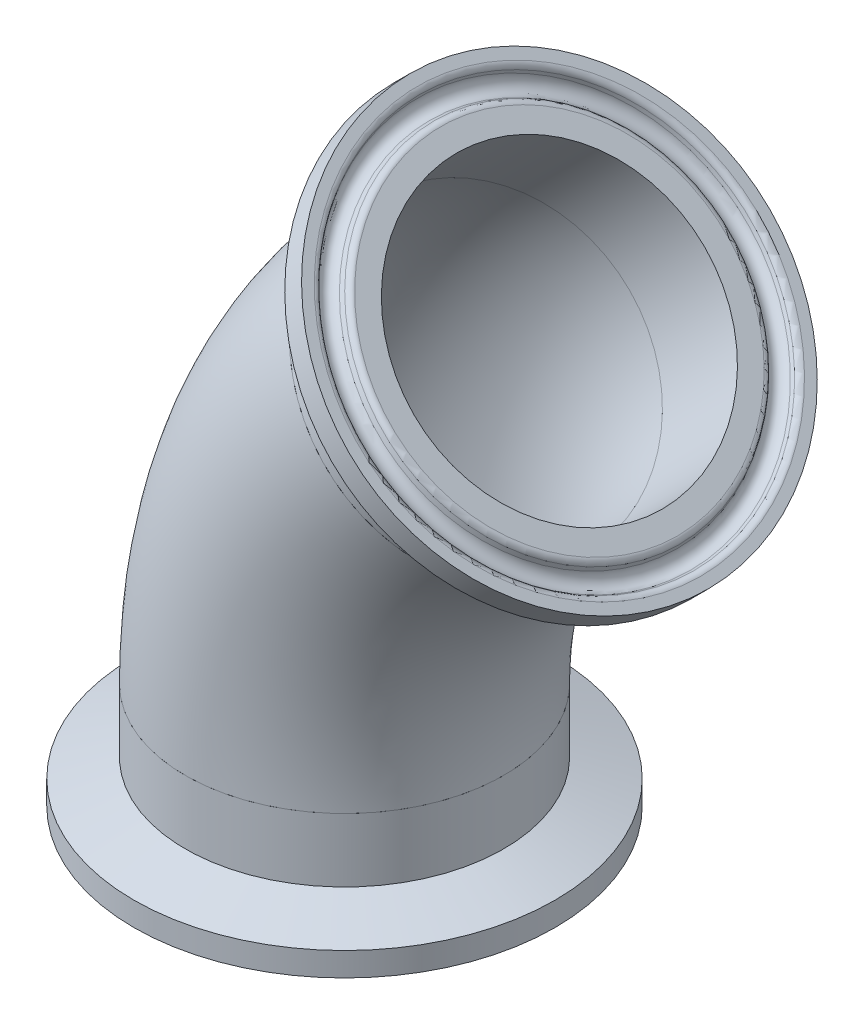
ISO-10303-21;
HEADER;
FILE_DESCRIPTION(('STEP AP214'),'2;1');
FILE_NAME('part.step','',(''),(''),'','','');
FILE_SCHEMA(('AUTOMOTIVE_DESIGN { 1 0 10303 214 1 1 1 1 }'));
ENDSEC;
DATA;
#1=APPLICATION_CONTEXT('core data for automotive mechanical design processes');
#2=APPLICATION_PROTOCOL_DEFINITION('international standard','automotive_design',2000,#1);
#3=PRODUCT_CONTEXT('',#1,'mechanical');
#4=PRODUCT('Part','Part','',(#3));
#5=PRODUCT_RELATED_PRODUCT_CATEGORY('part','',(#4));
#6=PRODUCT_DEFINITION_FORMATION('','',#4);
#7=PRODUCT_DEFINITION_CONTEXT('part definition',#1,'design');
#8=PRODUCT_DEFINITION('design','',#6,#7);
#9=PRODUCT_DEFINITION_SHAPE('','',#8);
#10=(LENGTH_UNIT() NAMED_UNIT(*) SI_UNIT(.MILLI.,.METRE.));
#11=(NAMED_UNIT(*) PLANE_ANGLE_UNIT() SI_UNIT($,.RADIAN.));
#12=(NAMED_UNIT(*) SI_UNIT($,.STERADIAN.) SOLID_ANGLE_UNIT());
#13=UNCERTAINTY_MEASURE_WITH_UNIT(LENGTH_MEASURE(1.E-05),#10,'distance_accuracy_value','');
#14=(GEOMETRIC_REPRESENTATION_CONTEXT(3) GLOBAL_UNCERTAINTY_ASSIGNED_CONTEXT((#13)) GLOBAL_UNIT_ASSIGNED_CONTEXT((#10,
#11,#12)) REPRESENTATION_CONTEXT('',''));
#15=CARTESIAN_POINT('',(0.,0.,0.));
#16=DIRECTION('',(0.,0.,1.));
#17=DIRECTION('',(1.,0.,0.));
#18=AXIS2_PLACEMENT_3D('',#15,#16,#17);
#19=CARTESIAN_POINT('',(66.8663289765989,3.66193996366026,33.3026614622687));
#20=DIRECTION('',(0.,0.,1.));
#21=DIRECTION('',(1.00000000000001,0.,0.));
#22=AXIS2_PLACEMENT_3D('',#19,#20,#21);
#23=TOROIDAL_SURFACE('',#22,57.15,19.05);
#24=CARTESIAN_POINT('',(26.4551764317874,44.0730925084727,33.3026614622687));
#25=DIRECTION('',(0.707106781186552,0.707106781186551,0.));
#26=DIRECTION('',(0.,0.,1.));
#27=AXIS2_PLACEMENT_3D('',#24,#25,#26);
#28=CIRCLE('',#27,19.05);
#29=CARTESIAN_POINT('',(12.9847922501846,57.5434766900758,33.3026614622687));
#30=VERTEX_POINT('',#29);
#31=EDGE_CURVE('P0_E10',#30,#30,#28,.T.);
#32=CARTESIAN_POINT('',(9.71632897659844,3.66193996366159,33.3026614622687));
#33=DIRECTION('',(0.,1.00000000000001,0.));
#34=DIRECTION('',(0.,0.,1.));
#35=AXIS2_PLACEMENT_3D('',#32,#33,#34);
#36=CIRCLE('',#35,19.05);
#37=CARTESIAN_POINT('',(-9.33367102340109,3.66193996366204,33.3026614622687));
#38=VERTEX_POINT('',#37);
#39=EDGE_CURVE('P0_E21',#38,#38,#36,.T.);
#40=CARTESIAN_POINT('',(66.8663289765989,3.66193996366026,33.3026614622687));
#41=DIRECTION('',(0.,0.,1.));
#42=DIRECTION('',(1.00000000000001,0.,0.));
#43=AXIS2_PLACEMENT_3D('',#40,#41,#42);
#44=CIRCLE('',#43,76.2);
#45=EDGE_CURVE('',#30,#38,#44,.T.);
#46=ORIENTED_EDGE('',*,*,#31,.F.);
#47=ORIENTED_EDGE('',*,*,#39,.T.);
#48=ORIENTED_EDGE('',*,*,#45,.T.);
#49=ORIENTED_EDGE('',*,*,#45,.F.);
#50=EDGE_LOOP('',(#46,#48,#47,#49));
#51=FACE_BOUND('',#50,.T.);
#52=ADVANCED_FACE('P0_F15',(#51),#23,.T.);
#53=CARTESIAN_POINT('',(26.4551764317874,44.0730925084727,33.3026614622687));
#54=DIRECTION('',(0.707106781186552,0.707106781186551,0.));
#55=DIRECTION('',(0.,0.,1.));
#56=AXIS2_PLACEMENT_3D('',#53,#54,#55);
#57=PLANE('',#56);
#58=CARTESIAN_POINT('',(26.4551764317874,44.0730925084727,33.3026614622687));
#59=DIRECTION('',(0.707106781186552,0.707106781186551,0.));
#60=DIRECTION('',(-0.707106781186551,0.707106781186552,0.));
#61=AXIS2_PLACEMENT_3D('',#58,#59,#60);
#62=CIRCLE('',#61,17.399);
#63=CARTESIAN_POINT('',(14.1522255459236,56.3760433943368,33.3026614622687));
#64=VERTEX_POINT('',#63);
#65=EDGE_CURVE('P0_E25',#64,#64,#62,.T.);
#66=ORIENTED_EDGE('',*,*,#65,.F.);
#67=EDGE_LOOP('',(#66));
#68=FACE_BOUND('',#67,.T.);
#69=ORIENTED_EDGE('',*,*,#31,.T.);
#70=EDGE_LOOP('',(#69));
#71=FACE_BOUND('',#70,.T.);
#72=ADVANCED_FACE('P0_F46',(#68,#71),#57,.T.);
#73=CARTESIAN_POINT('',(9.71632897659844,3.66193996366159,33.3026614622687));
#74=DIRECTION('',(0.,1.00000000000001,0.));
#75=DIRECTION('',(0.,0.,1.));
#76=AXIS2_PLACEMENT_3D('',#73,#74,#75);
#77=PLANE('',#76);
#78=CARTESIAN_POINT('',(9.71632897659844,3.66193996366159,33.3026614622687));
#79=DIRECTION('',(0.,1.00000000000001,0.));
#80=DIRECTION('',(0.,0.,1.));
#81=AXIS2_PLACEMENT_3D('',#78,#79,#80);
#82=CIRCLE('',#81,17.399);
#83=CARTESIAN_POINT('',(-7.68267102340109,3.661939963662,33.3026614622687));
#84=VERTEX_POINT('',#83);
#85=EDGE_CURVE('P0_E29',#84,#84,#82,.T.);
#86=ORIENTED_EDGE('',*,*,#85,.T.);
#87=EDGE_LOOP('',(#86));
#88=FACE_BOUND('',#87,.T.);
#89=ORIENTED_EDGE('',*,*,#39,.F.);
#90=EDGE_LOOP('',(#89));
#91=FACE_BOUND('',#90,.T.);
#92=ADVANCED_FACE('P0_F35',(#88,#91),#77,.F.);
#93=CARTESIAN_POINT('',(66.8663289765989,3.66193996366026,33.3026614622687));
#94=DIRECTION('',(0.,0.,1.));
#95=DIRECTION('',(1.00000000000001,0.,0.));
#96=AXIS2_PLACEMENT_3D('',#93,#94,#95);
#97=TOROIDAL_SURFACE('',#96,57.15,17.399);
#98=CARTESIAN_POINT('',(66.8663289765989,3.66193996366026,33.3026614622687));
#99=DIRECTION('',(0.,0.,1.));
#100=DIRECTION('',(1.00000000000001,0.,0.));
#101=AXIS2_PLACEMENT_3D('',#98,#99,#100);
#102=CIRCLE('',#101,74.549);
#103=EDGE_CURVE('',#64,#84,#102,.T.);
#104=ORIENTED_EDGE('',*,*,#65,.T.);
#105=ORIENTED_EDGE('',*,*,#85,.F.);
#106=ORIENTED_EDGE('',*,*,#103,.T.);
#107=ORIENTED_EDGE('',*,*,#103,.F.);
#108=EDGE_LOOP('',(#104,#106,#105,#107));
#109=FACE_BOUND('',#108,.T.);
#110=ADVANCED_FACE('P0_F38',(#109),#97,.F.);
#111=CLOSED_SHELL('',(#52,#72,#92,#110));
#112=MANIFOLD_SOLID_BREP('P0_B1',#111);
#113=CARTESIAN_POINT('',(34.7396402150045,52.3575562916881,33.3026614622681));
#114=DIRECTION('',(-0.707106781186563,-0.707106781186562,0.));
#115=DIRECTION('',(-0.707106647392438,0.707106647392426,-0.000615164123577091));
#116=AXIS2_PLACEMENT_3D('',#113,#114,#115);
#117=CONICAL_SURFACE('',#116,20.9336326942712,0.401425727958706);
#118=CARTESIAN_POINT('',(35.1071491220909,52.7250651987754,33.3026614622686));
#119=DIRECTION('',(0.707106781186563,0.707106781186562,0.));
#120=DIRECTION('',(0.707106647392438,-0.707106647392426,0.000615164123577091));
#121=AXIS2_PLACEMENT_3D('',#118,#119,#120);
#122=CIRCLE('',#121,20.7130178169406);
#123=CARTESIAN_POINT('',(49.7534617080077,38.0787526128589,33.3154033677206));
#124=VERTEX_POINT('',#123);
#125=EDGE_CURVE('P1_E9',#124,#124,#122,.T.);
#126=ORIENTED_EDGE('',*,*,#125,.F.);
#127=EDGE_LOOP('',(#126));
#128=FACE_BOUND('',#127,.T.);
#129=CARTESIAN_POINT('',(34.7396402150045,52.3575562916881,33.3026614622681));
#130=DIRECTION('',(0.707106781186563,0.707106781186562,0.));
#131=DIRECTION('',(0.707106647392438,-0.707106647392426,0.000615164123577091));
#132=AXIS2_PLACEMENT_3D('',#129,#130,#131);
#133=CIRCLE('',#132,20.9336326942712);
#134=CARTESIAN_POINT('',(49.5419510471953,37.5552454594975,33.3155390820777));
#135=VERTEX_POINT('',#134);
#136=EDGE_CURVE('P1_E54',#135,#135,#133,.T.);
#137=ORIENTED_EDGE('',*,*,#136,.T.);
#138=EDGE_LOOP('',(#137));
#139=FACE_BOUND('',#138,.T.);
#140=ADVANCED_FACE('P1_F14',(#128,#139),#117,.T.);
#141=CARTESIAN_POINT('',(34.896617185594,52.5145332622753,33.3026614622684));
#142=DIRECTION('',(0.707106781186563,0.707106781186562,0.));
#143=DIRECTION('',(0.707106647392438,-0.707106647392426,0.000615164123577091));
#144=AXIS2_PLACEMENT_3D('',#141,#142,#143);
#145=TOROIDAL_SURFACE('',#144,20.0115931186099,0.761999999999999);
#146=CARTESIAN_POINT('',(35.4354325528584,53.0533486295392,33.3026614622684));
#147=DIRECTION('',(0.707106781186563,0.707106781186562,0.));
#148=DIRECTION('',(0.707106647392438,-0.707106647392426,0.000615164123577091));
#149=AXIS2_PLACEMENT_3D('',#146,#147,#148);
#150=CIRCLE('',#149,20.0115931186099);
#151=CARTESIAN_POINT('',(49.5857630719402,38.9030181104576,33.3149718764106));
#152=VERTEX_POINT('',#151);
#153=EDGE_CURVE('P1_E20',#152,#152,#150,.T.);
#154=ORIENTED_EDGE('',*,*,#153,.F.);
#155=EDGE_LOOP('',(#154));
#156=FACE_BOUND('',#155,.T.);
#157=ORIENTED_EDGE('',*,*,#125,.T.);
#158=EDGE_LOOP('',(#157));
#159=FACE_BOUND('',#158,.T.);
#160=ADVANCED_FACE('P1_F84',(#156,#159),#145,.T.);
#161=CARTESIAN_POINT('',(35.4354325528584,53.0533486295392,33.3026614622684));
#162=DIRECTION('',(-0.707106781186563,-0.707106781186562,0.));
#163=DIRECTION('',(-0.707106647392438,0.707106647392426,-0.000615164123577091));
#164=AXIS2_PLACEMENT_3D('',#161,#162,#163);
#165=PLANE('',#164);
#166=CARTESIAN_POINT('',(35.4354325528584,53.0533486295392,33.3026614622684));
#167=DIRECTION('',(0.707106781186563,0.707106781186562,0.));
#168=DIRECTION('',(0.707106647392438,-0.707106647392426,0.000615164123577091));
#169=AXIS2_PLACEMENT_3D('',#166,#167,#168);
#170=CIRCLE('',#169,17.399);
#171=CARTESIAN_POINT('',(47.7383811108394,40.7504000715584,33.3133647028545));
#172=VERTEX_POINT('',#171);
#173=EDGE_CURVE('P1_E24',#172,#172,#170,.T.);
#174=ORIENTED_EDGE('',*,*,#173,.F.);
#175=EDGE_LOOP('',(#174));
#176=FACE_BOUND('',#175,.T.);
#177=ORIENTED_EDGE('',*,*,#153,.T.);
#178=EDGE_LOOP('',(#177));
#179=FACE_BOUND('',#178,.T.);
#180=ADVANCED_FACE('P1_F89',(#176,#179),#165,.F.);
#181=CARTESIAN_POINT('',(35.4354325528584,53.0533486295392,33.3026614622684));
#182=DIRECTION('',(0.707106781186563,0.707106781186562,0.));
#183=DIRECTION('',(0.707106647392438,-0.707106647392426,0.000615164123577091));
#184=AXIS2_PLACEMENT_3D('',#181,#182,#183);
#185=CYLINDRICAL_SURFACE('',#184,17.399);
#186=ORIENTED_EDGE('',*,*,#173,.T.);
#187=EDGE_LOOP('',(#186));
#188=FACE_BOUND('',#187,.T.);
#189=CARTESIAN_POINT('',(26.4551764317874,44.0730925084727,33.3026614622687));
#190=DIRECTION('',(0.707106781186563,0.707106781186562,0.));
#191=DIRECTION('',(0.707106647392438,-0.707106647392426,0.000615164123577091));
#192=AXIS2_PLACEMENT_3D('',#189,#190,#191);
#193=CIRCLE('',#192,17.399);
#194=CARTESIAN_POINT('',(38.7581249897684,31.7701439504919,33.3133647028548));
#195=VERTEX_POINT('',#194);
#196=EDGE_CURVE('P1_E28',#195,#195,#193,.T.);
#197=ORIENTED_EDGE('',*,*,#196,.F.);
#198=EDGE_LOOP('',(#197));
#199=FACE_BOUND('',#198,.T.);
#200=ADVANCED_FACE('P1_F94',(#188,#199),#185,.F.);
#201=CARTESIAN_POINT('',(26.4551764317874,44.0730925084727,33.3026614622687));
#202=DIRECTION('',(0.707106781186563,0.707106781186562,0.));
#203=DIRECTION('',(0.707106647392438,-0.707106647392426,0.000615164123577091));
#204=AXIS2_PLACEMENT_3D('',#201,#202,#203);
#205=PLANE('',#204);
#206=CARTESIAN_POINT('',(26.4551764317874,44.0730925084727,33.3026614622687));
#207=DIRECTION('',(0.707106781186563,0.707106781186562,0.));
#208=DIRECTION('',(0.707106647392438,-0.707106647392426,0.000615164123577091));
#209=AXIS2_PLACEMENT_3D('',#206,#207,#208);
#210=CIRCLE('',#209,19.05);
#211=CARTESIAN_POINT('',(39.9255580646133,30.602710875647,33.3143803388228));
#212=VERTEX_POINT('',#211);
#213=EDGE_CURVE('P1_E33',#212,#212,#210,.T.);
#214=ORIENTED_EDGE('',*,*,#213,.F.);
#215=EDGE_LOOP('',(#214));
#216=FACE_BOUND('',#215,.T.);
#217=ORIENTED_EDGE('',*,*,#196,.T.);
#218=EDGE_LOOP('',(#217));
#219=FACE_BOUND('',#218,.T.);
#220=ADVANCED_FACE('P1_F100',(#216,#219),#205,.F.);
#221=CARTESIAN_POINT('',(35.4354325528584,53.0533486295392,33.3026614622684));
#222=DIRECTION('',(0.707106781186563,0.707106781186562,0.));
#223=DIRECTION('',(0.707106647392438,-0.707106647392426,0.000615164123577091));
#224=AXIS2_PLACEMENT_3D('',#221,#222,#223);
#225=CYLINDRICAL_SURFACE('',#224,19.05);
#226=CARTESIAN_POINT('',(31.8418789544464,49.4597950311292,33.3026614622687));
#227=DIRECTION('',(0.707106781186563,0.707106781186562,0.));
#228=DIRECTION('',(0.707106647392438,-0.707106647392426,0.000615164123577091));
#229=AXIS2_PLACEMENT_3D('',#226,#227,#228);
#230=CIRCLE('',#229,19.05);
#231=CARTESIAN_POINT('',(45.3122605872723,35.9894133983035,33.3143803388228));
#232=VERTEX_POINT('',#231);
#233=EDGE_CURVE('P1_E36',#232,#232,#230,.T.);
#234=ORIENTED_EDGE('',*,*,#233,.F.);
#235=EDGE_LOOP('',(#234));
#236=FACE_BOUND('',#235,.T.);
#237=ORIENTED_EDGE('',*,*,#213,.T.);
#238=EDGE_LOOP('',(#237));
#239=FACE_BOUND('',#238,.T.);
#240=ADVANCED_FACE('P1_F104',(#236,#239),#225,.T.);
#241=CARTESIAN_POINT('',(31.8418789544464,49.4597950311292,33.3026614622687));
#242=DIRECTION('',(0.707106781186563,0.707106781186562,0.));
#243=DIRECTION('',(0.707106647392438,-0.707106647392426,0.000615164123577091));
#244=AXIS2_PLACEMENT_3D('',#241,#242,#243);
#245=CONICAL_SURFACE('',#244,19.05,1.22173047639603);
#246=CARTESIAN_POINT('',(33.4238551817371,51.0417712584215,33.3026614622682));
#247=DIRECTION('',(0.707106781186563,0.707106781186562,0.));
#248=DIRECTION('',(0.707106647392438,-0.707106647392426,0.000615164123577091));
#249=AXIS2_PLACEMENT_3D('',#246,#247,#248);
#250=CIRCLE('',#249,25.1968);
#251=CARTESIAN_POINT('',(51.2406799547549,33.224946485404,33.3181616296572));
#252=VERTEX_POINT('',#251);
#253=EDGE_CURVE('P1_E39',#252,#252,#250,.T.);
#254=ORIENTED_EDGE('',*,*,#253,.F.);
#255=EDGE_LOOP('',(#254));
#256=FACE_BOUND('',#255,.T.);
#257=ORIENTED_EDGE('',*,*,#233,.T.);
#258=EDGE_LOOP('',(#257));
#259=FACE_BOUND('',#258,.T.);
#260=ADVANCED_FACE('P1_F108',(#256,#259),#245,.T.);
#261=CARTESIAN_POINT('',(35.4354325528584,53.0533486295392,33.3026614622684));
#262=DIRECTION('',(0.707106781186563,0.707106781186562,0.));
#263=DIRECTION('',(0.707106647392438,-0.707106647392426,0.000615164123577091));
#264=AXIS2_PLACEMENT_3D('',#261,#262,#263);
#265=CYLINDRICAL_SURFACE('',#264,25.1968);
#266=CARTESIAN_POINT('',(35.4354325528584,53.0533486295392,33.3026614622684));
#267=DIRECTION('',(0.707106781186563,0.707106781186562,0.));
#268=DIRECTION('',(0.707106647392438,-0.707106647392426,0.000615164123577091));
#269=AXIS2_PLACEMENT_3D('',#266,#267,#268);
#270=CIRCLE('',#269,25.1968);
#271=CARTESIAN_POINT('',(53.2522573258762,35.2365238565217,33.3181616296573));
#272=VERTEX_POINT('',#271);
#273=EDGE_CURVE('P1_E42',#272,#272,#270,.T.);
#274=ORIENTED_EDGE('',*,*,#273,.F.);
#275=EDGE_LOOP('',(#274));
#276=FACE_BOUND('',#275,.T.);
#277=ORIENTED_EDGE('',*,*,#253,.T.);
#278=EDGE_LOOP('',(#277));
#279=FACE_BOUND('',#278,.T.);
#280=ADVANCED_FACE('P1_F80',(#276,#279),#265,.T.);
#281=CARTESIAN_POINT('',(35.4354325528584,53.0533486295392,33.3026614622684));
#282=DIRECTION('',(-0.707106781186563,-0.707106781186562,0.));
#283=DIRECTION('',(-0.707106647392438,0.707106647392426,-0.000615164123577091));
#284=AXIS2_PLACEMENT_3D('',#281,#282,#283);
#285=PLANE('',#284);
#286=CARTESIAN_POINT('',(35.4354325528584,53.0533486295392,33.3026614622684));
#287=DIRECTION('',(0.707106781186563,0.707106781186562,0.));
#288=DIRECTION('',(0.707106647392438,-0.707106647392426,0.000615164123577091));
#289=AXIS2_PLACEMENT_3D('',#286,#287,#288);
#290=CIRCLE('',#289,23.9521599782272);
#291=CARTESIAN_POINT('',(52.37216409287,36.1166170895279,33.3173959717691));
#292=VERTEX_POINT('',#291);
#293=EDGE_CURVE('P1_E45',#292,#292,#290,.T.);
#294=ORIENTED_EDGE('',*,*,#293,.F.);
#295=EDGE_LOOP('',(#294));
#296=FACE_BOUND('',#295,.T.);
#297=ORIENTED_EDGE('',*,*,#273,.T.);
#298=EDGE_LOOP('',(#297));
#299=FACE_BOUND('',#298,.T.);
#300=ADVANCED_FACE('P1_F73',(#296,#299),#285,.F.);
#301=CARTESIAN_POINT('',(34.896617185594,52.5145332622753,33.3026614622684));
#302=DIRECTION('',(0.707106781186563,0.707106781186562,0.));
#303=DIRECTION('',(0.707106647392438,-0.707106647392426,0.000615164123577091));
#304=AXIS2_PLACEMENT_3D('',#301,#302,#303);
#305=TOROIDAL_SURFACE('',#304,23.9521599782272,0.761999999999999);
#306=ORIENTED_EDGE('',*,*,#293,.T.);
#307=EDGE_LOOP('',(#306));
#308=FACE_BOUND('',#307,.T.);
#309=CARTESIAN_POINT('',(35.1071491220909,52.7250651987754,33.3026614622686));
#310=DIRECTION('',(0.707106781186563,0.707106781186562,0.));
#311=DIRECTION('',(0.707106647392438,-0.707106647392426,0.000615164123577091));
#312=AXIS2_PLACEMENT_3D('',#309,#310,#311);
#313=CIRCLE('',#312,23.2507352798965);
#314=CARTESIAN_POINT('',(51.5478985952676,36.284315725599,33.3169644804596));
#315=VERTEX_POINT('',#314);
#316=EDGE_CURVE('P1_E48',#315,#315,#313,.T.);
#317=ORIENTED_EDGE('',*,*,#316,.F.);
#318=EDGE_LOOP('',(#317));
#319=FACE_BOUND('',#318,.T.);
#320=ADVANCED_FACE('P1_F68',(#308,#319),#305,.T.);
#321=CARTESIAN_POINT('',(35.1071491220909,52.7250651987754,33.3026614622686));
#322=DIRECTION('',(0.707106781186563,0.707106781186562,0.));
#323=DIRECTION('',(0.707106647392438,-0.707106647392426,0.000615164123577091));
#324=AXIS2_PLACEMENT_3D('',#321,#322,#323);
#325=CONICAL_SURFACE('',#324,23.2507352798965,0.401425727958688);
#326=CARTESIAN_POINT('',(34.8182309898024,52.4361470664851,33.3026614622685));
#327=DIRECTION('',(0.707106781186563,0.707106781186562,0.));
#328=DIRECTION('',(0.707106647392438,-0.707106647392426,0.000615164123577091));
#329=AXIS2_PLACEMENT_3D('',#326,#327,#328);
#330=CIRCLE('',#329,23.0772982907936);
#331=CARTESIAN_POINT('',(51.1363420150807,36.118036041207,33.3168577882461));
#332=VERTEX_POINT('',#331);
#333=EDGE_CURVE('P1_E51',#332,#332,#330,.T.);
#334=ORIENTED_EDGE('',*,*,#333,.F.);
#335=EDGE_LOOP('',(#334));
#336=FACE_BOUND('',#335,.T.);
#337=ORIENTED_EDGE('',*,*,#316,.T.);
#338=EDGE_LOOP('',(#337));
#339=FACE_BOUND('',#338,.T.);
#340=ADVANCED_FACE('P1_F62',(#336,#339),#325,.F.);
#341=CARTESIAN_POINT('',(35.1480643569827,52.7659804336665,33.3026614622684));
#342=DIRECTION('',(0.707106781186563,0.707106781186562,0.));
#343=DIRECTION('',(0.707106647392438,-0.707106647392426,0.000615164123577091));
#344=AXIS2_PLACEMENT_3D('',#341,#342,#343);
#345=TOROIDAL_SURFACE('',#344,21.9783995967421,1.1938);
#346=ORIENTED_EDGE('',*,*,#136,.F.);
#347=EDGE_LOOP('',(#346));
#348=FACE_BOUND('',#347,.T.);
#349=ORIENTED_EDGE('',*,*,#333,.T.);
#350=EDGE_LOOP('',(#349));
#351=FACE_BOUND('',#350,.T.);
#352=ADVANCED_FACE('P1_F59',(#348,#351),#345,.F.);
#353=CLOSED_SHELL('',(#140,#160,#180,#200,#220,#240,#260,#280,#300,#320,#340,#352));
#354=MANIFOLD_SOLID_BREP('P1_B1',#353);
#355=CARTESIAN_POINT('',(9.71632897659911,-8.05406107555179,33.3026614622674));
#356=DIRECTION('',(0.,1.00000000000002,0.));
#357=DIRECTION('',(0.,0.,1.00000000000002));
#358=AXIS2_PLACEMENT_3D('',#355,#356,#357);
#359=CONICAL_SURFACE('',#358,20.9336326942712,0.401425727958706);
#360=CARTESIAN_POINT('',(9.7163289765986,-8.5737971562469,33.302661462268));
#361=DIRECTION('',(0.,-1.00000000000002,0.));
#362=DIRECTION('',(0.,0.,-1.00000000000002));
#363=AXIS2_PLACEMENT_3D('',#360,#361,#362);
#364=CIRCLE('',#363,20.7130178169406);
#365=CARTESIAN_POINT('',(9.7163289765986,-8.573797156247,12.589643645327));
#366=VERTEX_POINT('',#365);
#367=EDGE_CURVE('P2_E10',#366,#366,#364,.T.);
#368=ORIENTED_EDGE('',*,*,#367,.F.);
#369=EDGE_LOOP('',(#368));
#370=FACE_BOUND('',#369,.T.);
#371=CARTESIAN_POINT('',(9.71632897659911,-8.05406107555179,33.3026614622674));
#372=DIRECTION('',(0.,-1.00000000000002,0.));
#373=DIRECTION('',(0.,0.,-1.00000000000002));
#374=AXIS2_PLACEMENT_3D('',#371,#372,#373);
#375=CIRCLE('',#374,20.9336326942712);
#376=CARTESIAN_POINT('',(9.71632897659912,-8.05406107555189,12.3690287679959));
#377=VERTEX_POINT('',#376);
#378=EDGE_CURVE('P2_E55',#377,#377,#375,.T.);
#379=ORIENTED_EDGE('',*,*,#378,.T.);
#380=EDGE_LOOP('',(#379));
#381=FACE_BOUND('',#380,.T.);
#382=ADVANCED_FACE('P2_F15',(#370,#381),#359,.T.);
#383=CARTESIAN_POINT('',(9.71632897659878,-8.27606003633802,33.3026614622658));
#384=DIRECTION('',(0.,-1.00000000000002,0.));
#385=DIRECTION('',(0.,0.,-1.00000000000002));
#386=AXIS2_PLACEMENT_3D('',#383,#384,#385);
#387=TOROIDAL_SURFACE('',#386,20.0115931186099,0.761999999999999);
#388=CARTESIAN_POINT('',(9.71632897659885,-9.03806003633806,33.3026614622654));
#389=DIRECTION('',(0.,-1.00000000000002,0.));
#390=DIRECTION('',(0.,0.,-1.00000000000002));
#391=AXIS2_PLACEMENT_3D('',#388,#389,#390);
#392=CIRCLE('',#391,20.0115931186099);
#393=CARTESIAN_POINT('',(9.71632897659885,-9.03806003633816,13.2910683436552));
#394=VERTEX_POINT('',#393);
#395=EDGE_CURVE('P2_E21',#394,#394,#392,.T.);
#396=ORIENTED_EDGE('',*,*,#395,.F.);
#397=EDGE_LOOP('',(#396));
#398=FACE_BOUND('',#397,.T.);
#399=ORIENTED_EDGE('',*,*,#367,.T.);
#400=EDGE_LOOP('',(#399));
#401=FACE_BOUND('',#400,.T.);
#402=ADVANCED_FACE('P2_F85',(#398,#401),#387,.T.);
#403=CARTESIAN_POINT('',(9.71632897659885,-9.03806003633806,33.3026614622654));
#404=DIRECTION('',(0.,1.00000000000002,0.));
#405=DIRECTION('',(0.,0.,1.00000000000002));
#406=AXIS2_PLACEMENT_3D('',#403,#404,#405);
#407=PLANE('',#406);
#408=CARTESIAN_POINT('',(9.71632897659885,-9.03806003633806,33.3026614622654));
#409=DIRECTION('',(0.,-1.00000000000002,0.));
#410=DIRECTION('',(0.,0.,-1.00000000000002));
#411=AXIS2_PLACEMENT_3D('',#408,#409,#410);
#412=CIRCLE('',#411,17.399);
#413=CARTESIAN_POINT('',(9.71632897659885,-9.03806003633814,15.9036614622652));
#414=VERTEX_POINT('',#413);
#415=EDGE_CURVE('P2_E25',#414,#414,#412,.T.);
#416=ORIENTED_EDGE('',*,*,#415,.F.);
#417=EDGE_LOOP('',(#416));
#418=FACE_BOUND('',#417,.T.);
#419=ORIENTED_EDGE('',*,*,#395,.T.);
#420=EDGE_LOOP('',(#419));
#421=FACE_BOUND('',#420,.T.);
#422=ADVANCED_FACE('P2_F90',(#418,#421),#407,.F.);
#423=CARTESIAN_POINT('',(9.71632897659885,-9.03806003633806,33.3026614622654));
#424=DIRECTION('',(0.,-1.00000000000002,0.));
#425=DIRECTION('',(0.,0.,-1.00000000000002));
#426=AXIS2_PLACEMENT_3D('',#423,#424,#425);
#427=CYLINDRICAL_SURFACE('',#426,17.399);
#428=ORIENTED_EDGE('',*,*,#415,.T.);
#429=EDGE_LOOP('',(#428));
#430=FACE_BOUND('',#429,.T.);
#431=CARTESIAN_POINT('',(9.71632897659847,3.66193996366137,33.3026614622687));
#432=DIRECTION('',(0.,-1.00000000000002,0.));
#433=DIRECTION('',(0.,0.,-1.00000000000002));
#434=AXIS2_PLACEMENT_3D('',#431,#432,#433);
#435=CIRCLE('',#434,17.399);
#436=CARTESIAN_POINT('',(9.71632897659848,3.66193996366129,15.9036614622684));
#437=VERTEX_POINT('',#436);
#438=EDGE_CURVE('P2_E29',#437,#437,#435,.T.);
#439=ORIENTED_EDGE('',*,*,#438,.F.);
#440=EDGE_LOOP('',(#439));
#441=FACE_BOUND('',#440,.T.);
#442=ADVANCED_FACE('P2_F95',(#430,#441),#427,.F.);
#443=CARTESIAN_POINT('',(9.71632897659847,3.66193996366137,33.3026614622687));
#444=DIRECTION('',(0.,-1.00000000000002,0.));
#445=DIRECTION('',(0.,0.,-1.00000000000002));
#446=AXIS2_PLACEMENT_3D('',#443,#444,#445);
#447=PLANE('',#446);
#448=CARTESIAN_POINT('',(9.71632897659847,3.66193996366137,33.3026614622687));
#449=DIRECTION('',(0.,-1.00000000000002,0.));
#450=DIRECTION('',(0.,0.,-1.00000000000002));
#451=AXIS2_PLACEMENT_3D('',#448,#449,#450);
#452=CIRCLE('',#451,19.05);
#453=CARTESIAN_POINT('',(9.71632897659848,3.66193996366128,14.2526614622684));
#454=VERTEX_POINT('',#453);
#455=EDGE_CURVE('P2_E34',#454,#454,#452,.T.);
#456=ORIENTED_EDGE('',*,*,#455,.F.);
#457=EDGE_LOOP('',(#456));
#458=FACE_BOUND('',#457,.T.);
#459=ORIENTED_EDGE('',*,*,#438,.T.);
#460=EDGE_LOOP('',(#459));
#461=FACE_BOUND('',#460,.T.);
#462=ADVANCED_FACE('P2_F101',(#458,#461),#447,.F.);
#463=CARTESIAN_POINT('',(9.71632897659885,-9.03806003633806,33.3026614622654));
#464=DIRECTION('',(0.,-1.00000000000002,0.));
#465=DIRECTION('',(0.,0.,-1.00000000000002));
#466=AXIS2_PLACEMENT_3D('',#463,#464,#465);
#467=CYLINDRICAL_SURFACE('',#466,19.05);
#468=CARTESIAN_POINT('',(9.7163289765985,-3.95600780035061,33.3026614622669));
#469=DIRECTION('',(0.,-1.00000000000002,0.));
#470=DIRECTION('',(0.,0.,-1.00000000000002));
#471=AXIS2_PLACEMENT_3D('',#468,#469,#470);
#472=CIRCLE('',#471,19.05);
#473=CARTESIAN_POINT('',(9.7163289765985,-3.9560078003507,14.2526614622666));
#474=VERTEX_POINT('',#473);
#475=EDGE_CURVE('P2_E37',#474,#474,#472,.T.);
#476=ORIENTED_EDGE('',*,*,#475,.F.);
#477=EDGE_LOOP('',(#476));
#478=FACE_BOUND('',#477,.T.);
#479=ORIENTED_EDGE('',*,*,#455,.T.);
#480=EDGE_LOOP('',(#479));
#481=FACE_BOUND('',#480,.T.);
#482=ADVANCED_FACE('P2_F105',(#478,#481),#467,.T.);
#483=CARTESIAN_POINT('',(9.7163289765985,-3.95600780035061,33.3026614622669));
#484=DIRECTION('',(0.,-1.00000000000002,0.));
#485=DIRECTION('',(0.,0.,-1.00000000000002));
#486=AXIS2_PLACEMENT_3D('',#483,#484,#485);
#487=CONICAL_SURFACE('',#486,19.05,1.22173047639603);
#488=CARTESIAN_POINT('',(9.71632897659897,-6.19326003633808,33.302661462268));
#489=DIRECTION('',(0.,-1.00000000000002,0.));
#490=DIRECTION('',(0.,0.,-1.00000000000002));
#491=AXIS2_PLACEMENT_3D('',#488,#489,#490);
#492=CIRCLE('',#491,25.1968);
#493=CARTESIAN_POINT('',(9.71632897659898,-6.1932600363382,8.1058614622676));
#494=VERTEX_POINT('',#493);
#495=EDGE_CURVE('P2_E40',#494,#494,#492,.T.);
#496=ORIENTED_EDGE('',*,*,#495,.F.);
#497=EDGE_LOOP('',(#496));
#498=FACE_BOUND('',#497,.T.);
#499=ORIENTED_EDGE('',*,*,#475,.T.);
#500=EDGE_LOOP('',(#499));
#501=FACE_BOUND('',#500,.T.);
#502=ADVANCED_FACE('P2_F109',(#498,#501),#487,.T.);
#503=CARTESIAN_POINT('',(9.71632897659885,-9.03806003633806,33.3026614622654));
#504=DIRECTION('',(0.,-1.00000000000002,0.));
#505=DIRECTION('',(0.,0.,-1.00000000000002));
#506=AXIS2_PLACEMENT_3D('',#503,#504,#505);
#507=CYLINDRICAL_SURFACE('',#506,25.1968);
#508=CARTESIAN_POINT('',(9.71632897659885,-9.03806003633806,33.3026614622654));
#509=DIRECTION('',(0.,-1.00000000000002,0.));
#510=DIRECTION('',(0.,0.,-1.00000000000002));
#511=AXIS2_PLACEMENT_3D('',#508,#509,#510);
#512=CIRCLE('',#511,25.1968);
#513=CARTESIAN_POINT('',(9.71632897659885,-9.03806003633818,8.10586146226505));
#514=VERTEX_POINT('',#513);
#515=EDGE_CURVE('P2_E43',#514,#514,#512,.T.);
#516=ORIENTED_EDGE('',*,*,#515,.F.);
#517=EDGE_LOOP('',(#516));
#518=FACE_BOUND('',#517,.T.);
#519=ORIENTED_EDGE('',*,*,#495,.T.);
#520=EDGE_LOOP('',(#519));
#521=FACE_BOUND('',#520,.T.);
#522=ADVANCED_FACE('P2_F81',(#518,#521),#507,.T.);
#523=CARTESIAN_POINT('',(9.71632897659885,-9.03806003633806,33.3026614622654));
#524=DIRECTION('',(0.,1.00000000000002,0.));
#525=DIRECTION('',(0.,0.,1.00000000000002));
#526=AXIS2_PLACEMENT_3D('',#523,#524,#525);
#527=PLANE('',#526);
#528=CARTESIAN_POINT('',(9.71632897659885,-9.03806003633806,33.3026614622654));
#529=DIRECTION('',(0.,-1.00000000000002,0.));
#530=DIRECTION('',(0.,0.,-1.00000000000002));
#531=AXIS2_PLACEMENT_3D('',#528,#529,#530);
#532=CIRCLE('',#531,23.9521599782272);
#533=CARTESIAN_POINT('',(9.71632897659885,-9.03806003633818,9.35050148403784));
#534=VERTEX_POINT('',#533);
#535=EDGE_CURVE('P2_E46',#534,#534,#532,.T.);
#536=ORIENTED_EDGE('',*,*,#535,.F.);
#537=EDGE_LOOP('',(#536));
#538=FACE_BOUND('',#537,.T.);
#539=ORIENTED_EDGE('',*,*,#515,.T.);
#540=EDGE_LOOP('',(#539));
#541=FACE_BOUND('',#540,.T.);
#542=ADVANCED_FACE('P2_F74',(#538,#541),#527,.F.);
#543=CARTESIAN_POINT('',(9.71632897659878,-8.27606003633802,33.3026614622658));
#544=DIRECTION('',(0.,-1.00000000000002,0.));
#545=DIRECTION('',(0.,0.,-1.00000000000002));
#546=AXIS2_PLACEMENT_3D('',#543,#544,#545);
#547=TOROIDAL_SURFACE('',#546,23.9521599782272,0.761999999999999);
#548=ORIENTED_EDGE('',*,*,#535,.T.);
#549=EDGE_LOOP('',(#548));
#550=FACE_BOUND('',#549,.T.);
#551=CARTESIAN_POINT('',(9.7163289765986,-8.5737971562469,33.302661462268));
#552=DIRECTION('',(0.,-1.00000000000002,0.));
#553=DIRECTION('',(0.,0.,-1.00000000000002));
#554=AXIS2_PLACEMENT_3D('',#551,#552,#553);
#555=CIRCLE('',#554,23.2507352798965);
#556=CARTESIAN_POINT('',(9.7163289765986,-8.57379715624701,10.0519261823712));
#557=VERTEX_POINT('',#556);
#558=EDGE_CURVE('P2_E49',#557,#557,#555,.T.);
#559=ORIENTED_EDGE('',*,*,#558,.F.);
#560=EDGE_LOOP('',(#559));
#561=FACE_BOUND('',#560,.T.);
#562=ADVANCED_FACE('P2_F69',(#550,#561),#547,.T.);
#563=CARTESIAN_POINT('',(9.7163289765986,-8.5737971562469,33.302661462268));
#564=DIRECTION('',(0.,-1.00000000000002,0.));
#565=DIRECTION('',(0.,0.,-1.00000000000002));
#566=AXIS2_PLACEMENT_3D('',#563,#564,#565);
#567=CONICAL_SURFACE('',#566,23.2507352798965,0.401425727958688);
#568=CARTESIAN_POINT('',(9.71632897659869,-8.16520521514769,33.3026614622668));
#569=DIRECTION('',(0.,-1.00000000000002,0.));
#570=DIRECTION('',(0.,0.,-1.00000000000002));
#571=AXIS2_PLACEMENT_3D('',#568,#569,#570);
#572=CIRCLE('',#571,23.0772982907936);
#573=CARTESIAN_POINT('',(9.7163289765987,-8.1652052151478,10.2253631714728));
#574=VERTEX_POINT('',#573);
#575=EDGE_CURVE('P2_E52',#574,#574,#572,.T.);
#576=ORIENTED_EDGE('',*,*,#575,.F.);
#577=EDGE_LOOP('',(#576));
#578=FACE_BOUND('',#577,.T.);
#579=ORIENTED_EDGE('',*,*,#558,.T.);
#580=EDGE_LOOP('',(#579));
#581=FACE_BOUND('',#580,.T.);
#582=ADVANCED_FACE('P2_F63',(#578,#581),#567,.F.);
#583=CARTESIAN_POINT('',(9.7163289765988,-8.63166003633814,33.3026614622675));
#584=DIRECTION('',(0.,-1.00000000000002,0.));
#585=DIRECTION('',(0.,0.,-1.00000000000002));
#586=AXIS2_PLACEMENT_3D('',#583,#584,#585);
#587=TOROIDAL_SURFACE('',#586,21.9783995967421,1.1938);
#588=ORIENTED_EDGE('',*,*,#378,.F.);
#589=EDGE_LOOP('',(#588));
#590=FACE_BOUND('',#589,.T.);
#591=ORIENTED_EDGE('',*,*,#575,.T.);
#592=EDGE_LOOP('',(#591));
#593=FACE_BOUND('',#592,.T.);
#594=ADVANCED_FACE('P2_F60',(#590,#593),#587,.F.);
#595=CLOSED_SHELL('',(#382,#402,#422,#442,#462,#482,#502,#522,#542,#562,#582,#594));
#596=MANIFOLD_SOLID_BREP('P2_B1',#595);
#597=ADVANCED_BREP_SHAPE_REPRESENTATION('',(#18,#112,#354,#596),#14);
#598=SHAPE_DEFINITION_REPRESENTATION(#9,#597);
ENDSEC;
END-ISO-10303-21;
